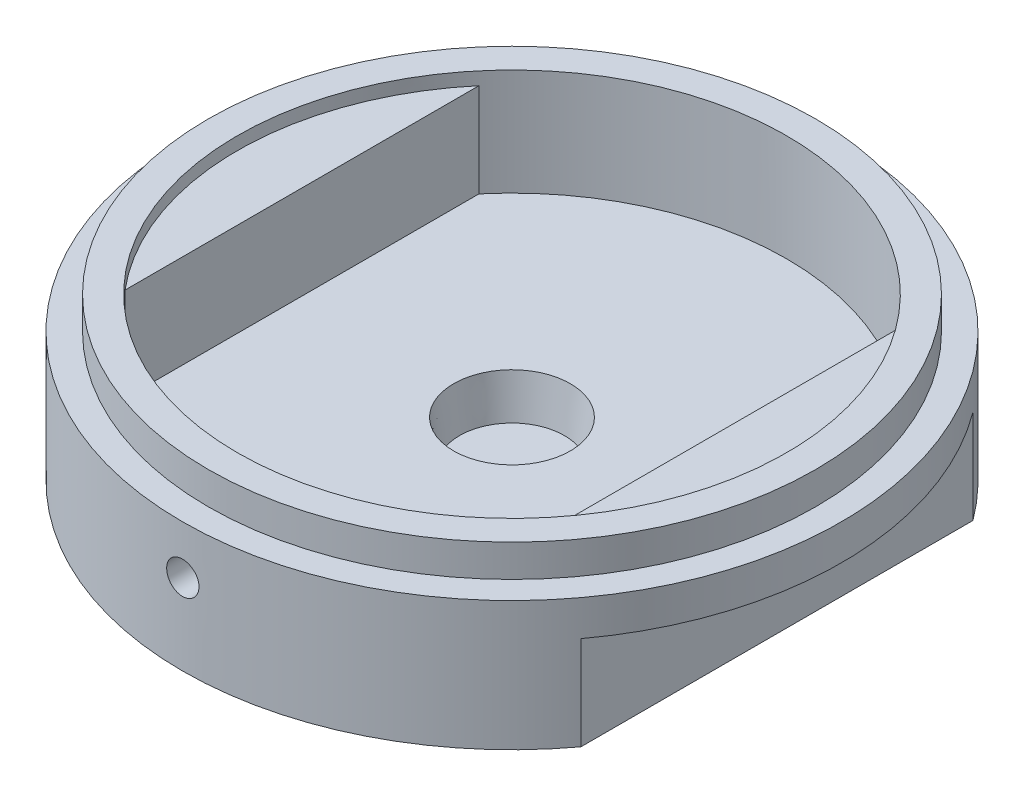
ISO-10303-21;
HEADER;
FILE_DESCRIPTION(('STEP AP214'),'2;1');
FILE_NAME('part.step','',(''),(''),'','','');
FILE_SCHEMA(('AUTOMOTIVE_DESIGN { 1 0 10303 214 1 1 1 1 }'));
ENDSEC;
DATA;
#1=APPLICATION_CONTEXT('core data for automotive mechanical design processes');
#2=APPLICATION_PROTOCOL_DEFINITION('international standard','automotive_design',2000,#1);
#3=PRODUCT_CONTEXT('',#1,'mechanical');
#4=PRODUCT('Part','Part','',(#3));
#5=PRODUCT_RELATED_PRODUCT_CATEGORY('part','',(#4));
#6=PRODUCT_DEFINITION_FORMATION('','',#4);
#7=PRODUCT_DEFINITION_CONTEXT('part definition',#1,'design');
#8=PRODUCT_DEFINITION('design','',#6,#7);
#9=PRODUCT_DEFINITION_SHAPE('','',#8);
#10=(LENGTH_UNIT() NAMED_UNIT(*) SI_UNIT(.MILLI.,.METRE.));
#11=(NAMED_UNIT(*) PLANE_ANGLE_UNIT() SI_UNIT($,.RADIAN.));
#12=(NAMED_UNIT(*) SI_UNIT($,.STERADIAN.) SOLID_ANGLE_UNIT());
#13=UNCERTAINTY_MEASURE_WITH_UNIT(LENGTH_MEASURE(1.E-05),#10,'distance_accuracy_value','');
#14=(GEOMETRIC_REPRESENTATION_CONTEXT(3) GLOBAL_UNCERTAINTY_ASSIGNED_CONTEXT((#13)) GLOBAL_UNIT_ASSIGNED_CONTEXT((#10,
#11,#12)) REPRESENTATION_CONTEXT('',''));
#15=CARTESIAN_POINT('',(0.,0.,0.));
#16=DIRECTION('',(0.,0.,1.));
#17=DIRECTION('',(1.,0.,0.));
#18=AXIS2_PLACEMENT_3D('',#15,#16,#17);
#19=CARTESIAN_POINT('',(0.,11.811,0.));
#20=DIRECTION('',(0.,-1.,0.));
#21=DIRECTION('',(0.,0.,-1.));
#22=AXIS2_PLACEMENT_3D('',#19,#20,#21);
#23=CYLINDRICAL_SURFACE('',#22,12.954);
#24=CARTESIAN_POINT('',(0.,9.144,0.));
#25=DIRECTION('',(0.,1.,0.));
#26=DIRECTION('',(0.,0.,1.));
#27=AXIS2_PLACEMENT_3D('',#24,#25,#26);
#28=CIRCLE('',#27,12.954);
#29=CARTESIAN_POINT('',(10.414,9.144,7.70420145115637));
#30=VERTEX_POINT('',#29);
#31=CARTESIAN_POINT('',(10.414,9.144,-7.70420145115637));
#32=VERTEX_POINT('',#31);
#33=EDGE_CURVE('E181',#30,#32,#28,.T.);
#34=ORIENTED_EDGE('',*,*,#33,.T.);
#35=DIRECTION('',(0.,-1.,0.));
#36=VECTOR('',#35,1.);
#37=CARTESIAN_POINT('',(10.414,11.811,-7.70420145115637));
#38=LINE('',#37,#36);
#39=CARTESIAN_POINT('',(10.414,5.461,-7.70420145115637));
#40=VERTEX_POINT('',#39);
#41=EDGE_CURVE('E11',#32,#40,#38,.T.);
#42=ORIENTED_EDGE('',*,*,#41,.T.);
#43=CARTESIAN_POINT('',(0.,5.461,0.));
#44=DIRECTION('',(0.,1.,0.));
#45=DIRECTION('',(0.,0.,1.));
#46=AXIS2_PLACEMENT_3D('',#43,#44,#45);
#47=CIRCLE('',#46,12.954);
#48=CARTESIAN_POINT('',(-10.414,5.461,-7.70420145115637));
#49=VERTEX_POINT('',#48);
#50=EDGE_CURVE('E156',#40,#49,#47,.T.);
#51=ORIENTED_EDGE('',*,*,#50,.T.);
#52=DIRECTION('',(0.,-1.,0.));
#53=VECTOR('',#52,1.);
#54=CARTESIAN_POINT('',(-10.414,11.811,-7.70420145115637));
#55=LINE('',#54,#53);
#56=CARTESIAN_POINT('',(-10.414,9.144,-7.70420145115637));
#57=VERTEX_POINT('',#56);
#58=EDGE_CURVE('E173',#49,#57,#55,.F.);
#59=ORIENTED_EDGE('',*,*,#58,.T.);
#60=CARTESIAN_POINT('',(0.,9.144,0.));
#61=DIRECTION('',(0.,1.,0.));
#62=DIRECTION('',(0.,0.,1.));
#63=AXIS2_PLACEMENT_3D('',#60,#61,#62);
#64=CIRCLE('',#63,12.954);
#65=CARTESIAN_POINT('',(-10.414,9.144,7.70420145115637));
#66=VERTEX_POINT('',#65);
#67=EDGE_CURVE('E176',#57,#66,#64,.T.);
#68=ORIENTED_EDGE('',*,*,#67,.T.);
#69=DIRECTION('',(0.,-1.,0.));
#70=VECTOR('',#69,1.);
#71=CARTESIAN_POINT('',(-10.414,11.811,7.70420145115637));
#72=LINE('',#71,#70);
#73=CARTESIAN_POINT('',(-10.414,5.461,7.70420145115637));
#74=VERTEX_POINT('',#73);
#75=EDGE_CURVE('E178',#66,#74,#72,.T.);
#76=ORIENTED_EDGE('',*,*,#75,.T.);
#77=CARTESIAN_POINT('',(10.414,5.461,7.70420145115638));
#78=VERTEX_POINT('',#77);
#79=EDGE_CURVE('E158',#74,#78,#47,.T.);
#80=ORIENTED_EDGE('',*,*,#79,.T.);
#81=DIRECTION('',(0.,-1.,0.));
#82=VECTOR('',#81,1.);
#83=CARTESIAN_POINT('',(10.414,11.811,7.70420145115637));
#84=LINE('',#83,#82);
#85=EDGE_CURVE('E39',#78,#30,#84,.F.);
#86=ORIENTED_EDGE('',*,*,#85,.T.);
#87=EDGE_LOOP('',(#34,#42,#51,#59,#68,#76,#80,#86));
#88=FACE_BOUND('',#87,.T.);
#89=CARTESIAN_POINT('',(0.,10.541,0.));
#90=DIRECTION('',(0.,1.,0.));
#91=DIRECTION('',(0.,0.,1.));
#92=AXIS2_PLACEMENT_3D('',#89,#90,#91);
#93=CIRCLE('',#92,12.954);
#94=CARTESIAN_POINT('',(0.,10.541,12.954));
#95=VERTEX_POINT('',#94);
#96=EDGE_CURVE('E145',#95,#95,#93,.T.);
#97=ORIENTED_EDGE('',*,*,#96,.F.);
#98=EDGE_LOOP('',(#97));
#99=FACE_BOUND('',#98,.T.);
#100=CARTESIAN_POINT('',(0.,8.001,12.954));
#101=CARTESIAN_POINT('',(0.0356452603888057,8.00100157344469,12.9539997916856));
#102=CARTESIAN_POINT('',(0.0713158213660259,8.0040114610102,12.9538512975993));
#103=CARTESIAN_POINT('',(0.141672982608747,8.01597584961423,12.9532732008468));
#104=CARTESIAN_POINT('',(0.176358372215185,8.02493736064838,12.9528432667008));
#105=CARTESIAN_POINT('',(0.243715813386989,8.04854785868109,12.9517509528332));
#106=CARTESIAN_POINT('',(0.276388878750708,8.06319395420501,12.9510886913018));
#107=CARTESIAN_POINT('',(0.338803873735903,8.09775344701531,12.9496063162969));
#108=CARTESIAN_POINT('',(0.368546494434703,8.11766559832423,12.9487862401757));
#109=CARTESIAN_POINT('',(0.424294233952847,8.16221365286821,12.9470795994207));
#110=CARTESIAN_POINT('',(0.450296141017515,8.18685357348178,12.9461929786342));
#111=CARTESIAN_POINT('',(0.497796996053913,8.2401497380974,12.9444536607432));
#112=CARTESIAN_POINT('',(0.519295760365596,8.26880614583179,12.9436009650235));
#113=CARTESIAN_POINT('',(0.557188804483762,8.32933854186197,12.9420252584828));
#114=CARTESIAN_POINT('',(0.573580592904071,8.36121609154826,12.9413023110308));
#115=CARTESIAN_POINT('',(0.600778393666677,8.42727489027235,12.9400683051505));
#116=CARTESIAN_POINT('',(0.611584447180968,8.46145612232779,12.9395572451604));
#117=CARTESIAN_POINT('',(0.627295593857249,8.53112261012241,12.9388051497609));
#118=CARTESIAN_POINT('',(0.632205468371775,8.56660678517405,12.9385638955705));
#119=CARTESIAN_POINT('',(0.635999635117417,8.63789643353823,12.9383779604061));
#120=CARTESIAN_POINT('',(0.63488397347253,8.67370190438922,12.9384332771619));
#121=CARTESIAN_POINT('',(0.626662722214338,8.74458526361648,12.9388340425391));
#122=CARTESIAN_POINT('',(0.619562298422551,8.77966375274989,12.9391792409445));
#123=CARTESIAN_POINT('',(0.599581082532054,8.84813031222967,12.9401204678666));
#124=CARTESIAN_POINT('',(0.586700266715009,8.8815183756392,12.9407164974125));
#125=CARTESIAN_POINT('',(0.555518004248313,8.94567296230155,12.9420924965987));
#126=CARTESIAN_POINT('',(0.537214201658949,8.97643833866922,12.9428725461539));
#127=CARTESIAN_POINT('',(0.495707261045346,9.03446168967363,12.9445285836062));
#128=CARTESIAN_POINT('',(0.472504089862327,9.0617196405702,12.9454045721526));
#129=CARTESIAN_POINT('',(0.421827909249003,9.11198445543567,12.9471548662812));
#130=CARTESIAN_POINT('',(0.394350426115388,9.13498680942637,12.9480291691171));
#131=CARTESIAN_POINT('',(0.335921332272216,9.17605272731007,12.9496766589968));
#132=CARTESIAN_POINT('',(0.304969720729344,9.19411629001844,12.9504498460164));
#133=CARTESIAN_POINT('',(0.240468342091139,9.22479143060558,12.9518079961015));
#134=CARTESIAN_POINT('',(0.206918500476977,9.23740285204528,12.9523929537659));
#135=CARTESIAN_POINT('',(0.138174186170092,9.25681277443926,12.9533086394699));
#136=CARTESIAN_POINT('',(0.102979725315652,9.26361131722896,12.953639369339));
#137=CARTESIAN_POINT('',(0.0319843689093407,9.27119694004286,12.9540090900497));
#138=CARTESIAN_POINT('',(-0.00381585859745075,9.27199025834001,12.9540483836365));
#139=CARTESIAN_POINT('',(-0.0750409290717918,9.26755919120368,12.953831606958));
#140=CARTESIAN_POINT('',(-0.110465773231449,9.26233482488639,12.9535755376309));
#141=CARTESIAN_POINT('',(-0.1799170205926,9.24602185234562,12.9527970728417));
#142=CARTESIAN_POINT('',(-0.213944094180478,9.23493609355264,12.9522748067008));
#143=CARTESIAN_POINT('',(-0.27965454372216,9.20721790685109,12.951022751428));
#144=CARTESIAN_POINT('',(-0.311337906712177,9.19058544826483,12.9502929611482));
#145=CARTESIAN_POINT('',(-0.371490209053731,9.15223001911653,12.9487072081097));
#146=CARTESIAN_POINT('',(-0.399956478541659,9.1305028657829,12.9478511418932));
#147=CARTESIAN_POINT('',(-0.452839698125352,9.08258091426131,12.9461095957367));
#148=CARTESIAN_POINT('',(-0.477256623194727,9.05638608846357,12.945224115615));
#149=CARTESIAN_POINT('',(-0.521369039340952,9.00024553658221,12.943522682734));
#150=CARTESIAN_POINT('',(-0.541060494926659,8.97029663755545,12.9427067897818));
#151=CARTESIAN_POINT('',(-0.575135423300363,8.90751411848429,12.9412374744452));
#152=CARTESIAN_POINT('',(-0.589518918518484,8.87468051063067,12.9405840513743));
#153=CARTESIAN_POINT('',(-0.612562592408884,8.80707556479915,12.9395137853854));
#154=CARTESIAN_POINT('',(-0.621225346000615,8.77230510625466,12.9390968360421));
#155=CARTESIAN_POINT('',(-0.63259005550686,8.70180115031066,12.9385462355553));
#156=CARTESIAN_POINT('',(-0.635292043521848,8.66606765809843,12.9384125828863));
#157=CARTESIAN_POINT('',(-0.634658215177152,8.59469215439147,12.9384436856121));
#158=CARTESIAN_POINT('',(-0.631328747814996,8.55905008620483,12.9386081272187));
#159=CARTESIAN_POINT('',(-0.618739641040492,8.48883158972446,12.9392162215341));
#160=CARTESIAN_POINT('',(-0.609479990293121,8.45425516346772,12.9396598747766));
#161=CARTESIAN_POINT('',(-0.585294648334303,8.38714808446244,12.9407763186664));
#162=CARTESIAN_POINT('',(-0.570368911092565,8.35461744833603,12.9414491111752));
#163=CARTESIAN_POINT('',(-0.53527620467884,8.29252346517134,12.942947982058));
#164=CARTESIAN_POINT('',(-0.515109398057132,8.2629600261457,12.9437740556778));
#165=CARTESIAN_POINT('',(-0.470084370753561,8.20760798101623,12.9454873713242));
#166=CARTESIAN_POINT('',(-0.44522174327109,8.18182296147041,12.9463746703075));
#167=CARTESIAN_POINT('',(-0.391513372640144,8.13478479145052,12.9481100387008));
#168=CARTESIAN_POINT('',(-0.362666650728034,8.11353275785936,12.9489580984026));
#169=CARTESIAN_POINT('',(-0.301786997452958,8.07615427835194,12.9505199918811));
#170=CARTESIAN_POINT('',(-0.269751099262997,8.06003266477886,12.9512336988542));
#171=CARTESIAN_POINT('',(-0.203447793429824,8.03341618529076,12.9524445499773));
#172=CARTESIAN_POINT('',(-0.169183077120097,8.02291466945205,12.9529419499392));
#173=CARTESIAN_POINT('',(-0.11225437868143,8.01059278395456,12.9535324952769));
#174=CARTESIAN_POINT('',(-0.0899591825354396,8.0070000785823,12.9537070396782));
#175=CARTESIAN_POINT('',(-0.0451127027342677,8.00220318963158,12.9539408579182));
#176=CARTESIAN_POINT('',(-0.0225614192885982,8.00099900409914,12.9540001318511));
#177=CARTESIAN_POINT('',(0.,8.001,12.954));
#178=B_SPLINE_CURVE_WITH_KNOTS('',3,(#100,#101,#102,#103,#104,#105,#106,#107,#108,#109,#110,
#111,#112,#113,#114,#115,#116,#117,#118,#119,#120,#121,#122,#123,#124,#125,#126,#127,#128,#129,
#130,#131,#132,#133,#134,#135,#136,#137,#138,#139,#140,#141,#142,#143,#144,#145,#146,#147,#148,
#149,#150,#151,#152,#153,#154,#155,#156,#157,#158,#159,#160,#161,#162,#163,#164,#165,#166,#167,
#168,#169,#170,#171,#172,#173,#174,#175,#176,#177),.UNSPECIFIED.,.T.,.F.,(4,2,2,2,2,2,2,2,2,2,2,
2,2,2,2,2,2,2,2,2,2,2,2,2,2,2,2,2,2,2,2,2,2,2,2,2,2,2,4),(0.,0.106853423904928,0.21383292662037,
0.320758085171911,0.427657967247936,0.534649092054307,0.641644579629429,0.748692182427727,
0.855738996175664,0.962698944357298,1.06965807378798,1.17652497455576,1.28339231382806,
1.39030614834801,1.49722070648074,1.60424792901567,1.71127517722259,1.81830549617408,
1.92533504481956,2.03225339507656,2.13917140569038,2.24603752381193,2.35290423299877,
2.45985898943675,2.56681440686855,2.67386084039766,2.78090682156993,2.88790458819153,
2.99490177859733,3.10178640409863,3.20867123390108,3.31555693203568,3.42243931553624,
3.52942250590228,3.63643202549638,3.74354204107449,3.85052503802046,3.91815722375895,
3.98578935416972),.UNSPECIFIED.);
#179=CARTESIAN_POINT('',(0.,8.001,12.954));
#180=VERTEX_POINT('',#179);
#181=EDGE_CURVE('E221',#180,#180,#178,.T.);
#182=ORIENTED_EDGE('',*,*,#181,.F.);
#183=EDGE_LOOP('',(#182));
#184=FACE_BOUND('',#183,.T.);
#185=ADVANCED_FACE('F26',(#88,#99,#184),#23,.T.);
#186=CARTESIAN_POINT('',(0.,11.811,0.));
#187=DIRECTION('',(0.,-1.,0.));
#188=DIRECTION('',(0.,0.,-1.));
#189=AXIS2_PLACEMENT_3D('',#186,#187,#188);
#190=CYLINDRICAL_SURFACE('',#189,10.795);
#191=CARTESIAN_POINT('',(0.,11.303,0.));
#192=DIRECTION('',(0.,1.,0.));
#193=DIRECTION('',(0.,0.,1.));
#194=AXIS2_PLACEMENT_3D('',#191,#192,#193);
#195=CIRCLE('',#194,10.795);
#196=CARTESIAN_POINT('',(8.255,11.303,6.95607648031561));
#197=VERTEX_POINT('',#196);
#198=CARTESIAN_POINT('',(8.255,11.303,-6.95607648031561));
#199=VERTEX_POINT('',#198);
#200=EDGE_CURVE('E133',#197,#199,#195,.T.);
#201=ORIENTED_EDGE('',*,*,#200,.F.);
#202=DIRECTION('',(0.,-1.,0.));
#203=VECTOR('',#202,1.);
#204=CARTESIAN_POINT('',(8.255,7.62,6.95607648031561));
#205=LINE('',#204,#203);
#206=CARTESIAN_POINT('',(8.255,7.62,6.95607648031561));
#207=VERTEX_POINT('',#206);
#208=EDGE_CURVE('E136',#207,#197,#205,.F.);
#209=ORIENTED_EDGE('',*,*,#208,.F.);
#210=CARTESIAN_POINT('',(0.,7.62,0.));
#211=DIRECTION('',(0.,1.,0.));
#212=DIRECTION('',(0.,0.,1.));
#213=AXIS2_PLACEMENT_3D('',#210,#211,#212);
#214=CIRCLE('',#213,10.795);
#215=CARTESIAN_POINT('',(-8.255,7.62,6.95607648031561));
#216=VERTEX_POINT('',#215);
#217=EDGE_CURVE('E110',#216,#207,#214,.T.);
#218=ORIENTED_EDGE('',*,*,#217,.F.);
#219=DIRECTION('',(0.,-1.,0.));
#220=VECTOR('',#219,1.);
#221=CARTESIAN_POINT('',(-8.255,11.303,6.95607648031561));
#222=LINE('',#221,#220);
#223=CARTESIAN_POINT('',(-8.255,11.303,6.95607648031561));
#224=VERTEX_POINT('',#223);
#225=EDGE_CURVE('E125',#224,#216,#222,.T.);
#226=ORIENTED_EDGE('',*,*,#225,.F.);
#227=CARTESIAN_POINT('',(0.,11.303,0.));
#228=DIRECTION('',(0.,1.,0.));
#229=DIRECTION('',(0.,0.,1.));
#230=AXIS2_PLACEMENT_3D('',#227,#228,#229);
#231=CIRCLE('',#230,10.795);
#232=CARTESIAN_POINT('',(-8.255,11.303,-6.95607648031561));
#233=VERTEX_POINT('',#232);
#234=EDGE_CURVE('E119',#233,#224,#231,.T.);
#235=ORIENTED_EDGE('',*,*,#234,.F.);
#236=DIRECTION('',(0.,-1.,0.));
#237=VECTOR('',#236,1.);
#238=CARTESIAN_POINT('',(-8.255,7.62,-6.95607648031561));
#239=LINE('',#238,#237);
#240=CARTESIAN_POINT('',(-8.255,7.62,-6.95607648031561));
#241=VERTEX_POINT('',#240);
#242=EDGE_CURVE('E115',#241,#233,#239,.F.);
#243=ORIENTED_EDGE('',*,*,#242,.F.);
#244=CARTESIAN_POINT('',(0.,7.62,0.));
#245=DIRECTION('',(0.,1.,0.));
#246=DIRECTION('',(0.,0.,1.));
#247=AXIS2_PLACEMENT_3D('',#244,#245,#246);
#248=CIRCLE('',#247,10.795);
#249=CARTESIAN_POINT('',(8.255,7.62,-6.95607648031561));
#250=VERTEX_POINT('',#249);
#251=EDGE_CURVE('E97',#250,#241,#248,.T.);
#252=ORIENTED_EDGE('',*,*,#251,.F.);
#253=DIRECTION('',(0.,-1.,0.));
#254=VECTOR('',#253,1.);
#255=CARTESIAN_POINT('',(8.255,11.303,-6.95607648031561));
#256=LINE('',#255,#254);
#257=EDGE_CURVE('E137',#199,#250,#256,.T.);
#258=ORIENTED_EDGE('',*,*,#257,.F.);
#259=EDGE_LOOP('',(#201,#209,#218,#226,#235,#243,#252,#258));
#260=FACE_BOUND('',#259,.T.);
#261=CARTESIAN_POINT('',(0.,11.811,0.));
#262=DIRECTION('',(0.,1.,0.));
#263=DIRECTION('',(0.,0.,1.));
#264=AXIS2_PLACEMENT_3D('',#261,#262,#263);
#265=CIRCLE('',#264,10.795);
#266=CARTESIAN_POINT('',(0.,11.811,10.795));
#267=VERTEX_POINT('',#266);
#268=EDGE_CURVE('E146',#267,#267,#265,.T.);
#269=ORIENTED_EDGE('',*,*,#268,.T.);
#270=EDGE_LOOP('',(#269));
#271=FACE_BOUND('',#270,.T.);
#272=CARTESIAN_POINT('',(-0.635,8.636,10.776307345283));
#273=CARTESIAN_POINT('',(-0.634998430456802,8.60036489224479,10.776307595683));
#274=CARTESIAN_POINT('',(-0.631990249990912,8.56470473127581,10.7764860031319));
#275=CARTESIAN_POINT('',(-0.620033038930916,8.49436878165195,10.7771804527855));
#276=CARTESIAN_POINT('',(-0.6110770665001,8.45969419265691,10.7776968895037));
#277=CARTESIAN_POINT('',(-0.58748214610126,8.39235841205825,10.7790086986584));
#278=CARTESIAN_POINT('',(-0.572846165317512,8.35969617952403,10.7798039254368));
#279=CARTESIAN_POINT('',(-0.538311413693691,8.29730070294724,10.7815835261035));
#280=CARTESIAN_POINT('',(-0.518413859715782,8.26756678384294,10.782567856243));
#281=CARTESIAN_POINT('',(-0.473891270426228,8.21182326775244,10.7846162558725));
#282=CARTESIAN_POINT('',(-0.449260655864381,8.18581812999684,10.7856804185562));
#283=CARTESIAN_POINT('',(-0.395982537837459,8.13830849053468,10.7877677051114));
#284=CARTESIAN_POINT('',(-0.367334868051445,8.11680417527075,10.7887908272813));
#285=CARTESIAN_POINT('',(-0.306811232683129,8.07889334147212,10.790681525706));
#286=CARTESIAN_POINT('',(-0.274932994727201,8.06249044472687,10.7915489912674));
#287=CARTESIAN_POINT('',(-0.208869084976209,8.03527127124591,10.7930296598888));
#288=CARTESIAN_POINT('',(-0.174683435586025,8.02445494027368,10.7936428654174));
#289=CARTESIAN_POINT('',(-0.105017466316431,8.00872812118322,10.7945452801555));
#290=CARTESIAN_POINT('',(-0.0695387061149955,8.00381074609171,10.7948348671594));
#291=CARTESIAN_POINT('',(0.00174176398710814,8.00000016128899,10.7950586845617));
#292=CARTESIAN_POINT('',(0.0375434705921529,8.00110689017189,10.7949929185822));
#293=CARTESIAN_POINT('',(0.108406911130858,8.0093074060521,10.794513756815));
#294=CARTESIAN_POINT('',(0.143469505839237,8.01639378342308,10.7941007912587));
#295=CARTESIAN_POINT('',(0.211906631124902,8.03634094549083,10.7929742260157));
#296=CARTESIAN_POINT('',(0.245281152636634,8.04920176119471,10.7922606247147));
#297=CARTESIAN_POINT('',(0.309418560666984,8.08034113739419,10.7906124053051));
#298=CARTESIAN_POINT('',(0.340179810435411,8.09862306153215,10.7896776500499));
#299=CARTESIAN_POINT('',(0.398199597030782,8.14008324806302,10.7876923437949));
#300=CARTESIAN_POINT('',(0.425458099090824,8.1632615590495,10.7866417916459));
#301=CARTESIAN_POINT('',(0.475741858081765,8.21389843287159,10.7845412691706));
#302=CARTESIAN_POINT('',(0.498760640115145,8.24136342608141,10.7834913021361));
#303=CARTESIAN_POINT('',(0.539861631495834,8.29977148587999,10.7815119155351));
#304=CARTESIAN_POINT('',(0.557943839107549,8.33071455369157,10.7805824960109));
#305=CARTESIAN_POINT('',(0.588657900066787,8.39520445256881,10.7789491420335));
#306=CARTESIAN_POINT('',(0.601289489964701,8.42875140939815,10.7782452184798));
#307=CARTESIAN_POINT('',(0.620739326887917,8.49749496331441,10.7771426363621));
#308=CARTESIAN_POINT('',(0.627557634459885,8.53269154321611,10.7767439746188));
#309=CARTESIAN_POINT('',(0.635179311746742,8.60367878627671,10.7762974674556));
#310=CARTESIAN_POINT('',(0.635991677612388,8.63946848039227,10.7762490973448));
#311=CARTESIAN_POINT('',(0.631601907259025,8.71067564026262,10.7765072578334));
#312=CARTESIAN_POINT('',(0.626399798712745,8.74609310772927,10.7768137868));
#313=CARTESIAN_POINT('',(0.610136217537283,8.81552505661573,10.7777467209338));
#314=CARTESIAN_POINT('',(0.599078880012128,8.84954050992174,10.778372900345));
#315=CARTESIAN_POINT('',(0.571422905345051,8.91523283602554,10.7798743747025));
#316=CARTESIAN_POINT('',(0.554824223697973,8.94690969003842,10.7807496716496));
#317=CARTESIAN_POINT('',(0.516533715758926,9.00706697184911,10.7826520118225));
#318=CARTESIAN_POINT('',(0.494835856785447,9.03554355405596,10.7836792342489));
#319=CARTESIAN_POINT('',(0.446971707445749,9.08845322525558,10.785769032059));
#320=CARTESIAN_POINT('',(0.420805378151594,9.11288627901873,10.7868316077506));
#321=CARTESIAN_POINT('',(0.364708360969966,9.15704566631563,10.7888739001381));
#322=CARTESIAN_POINT('',(0.334773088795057,9.17676618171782,10.7898535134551));
#323=CARTESIAN_POINT('',(0.272011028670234,9.21090089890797,10.7916180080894));
#324=CARTESIAN_POINT('',(0.239184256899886,9.22531513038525,10.7924028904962));
#325=CARTESIAN_POINT('',(0.171592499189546,9.24841797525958,10.793688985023));
#326=CARTESIAN_POINT('',(0.136828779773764,9.25711028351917,10.7941903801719));
#327=CARTESIAN_POINT('',(0.0663322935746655,9.26853463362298,10.794853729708));
#328=CARTESIAN_POINT('',(0.0305995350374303,9.27126672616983,10.7950156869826));
#329=CARTESIAN_POINT('',(-0.040763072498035,9.27069260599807,10.7949819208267));
#330=CARTESIAN_POINT('',(-0.0763929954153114,9.26739550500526,10.7947867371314));
#331=CARTESIAN_POINT('',(-0.146592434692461,9.25487546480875,10.7940617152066));
#332=CARTESIAN_POINT('',(-0.181161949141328,9.24565251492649,10.7935318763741));
#333=CARTESIAN_POINT('',(-0.248260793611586,9.22154458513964,10.7921971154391));
#334=CARTESIAN_POINT('',(-0.280790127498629,9.20665961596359,10.7913921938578));
#335=CARTESIAN_POINT('',(-0.342889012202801,9.17165152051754,10.7895976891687));
#336=CARTESIAN_POINT('',(-0.372458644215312,9.15152853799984,10.7886081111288));
#337=CARTESIAN_POINT('',(-0.427844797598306,9.10658220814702,10.7865538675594));
#338=CARTESIAN_POINT('',(-0.453656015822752,9.08175233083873,10.7854890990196));
#339=CARTESIAN_POINT('',(-0.500752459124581,9.02810473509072,10.7834052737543));
#340=CARTESIAN_POINT('',(-0.522036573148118,8.99928604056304,10.7823862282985));
#341=CARTESIAN_POINT('',(-0.559488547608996,8.93844920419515,10.7805079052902));
#342=CARTESIAN_POINT('',(-0.575650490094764,8.906427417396,10.7796488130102));
#343=CARTESIAN_POINT('',(-0.602348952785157,8.84014324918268,10.7781900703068));
#344=CARTESIAN_POINT('',(-0.612892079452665,8.80588355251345,10.7775901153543));
#345=CARTESIAN_POINT('',(-0.62530535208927,8.74884434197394,10.7768752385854));
#346=CARTESIAN_POINT('',(-0.628936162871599,8.72643377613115,10.7766632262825));
#347=CARTESIAN_POINT('',(-0.633783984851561,8.68135218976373,10.7763792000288));
#348=CARTESIAN_POINT('',(-0.635000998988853,8.65868116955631,10.7763071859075));
#349=CARTESIAN_POINT('',(-0.635,8.636,10.776307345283));
#350=B_SPLINE_CURVE_WITH_KNOTS('',3,(#272,#273,#274,#275,#276,#277,#278,#279,#280,#281,#282,
#283,#284,#285,#286,#287,#288,#289,#290,#291,#292,#293,#294,#295,#296,#297,#298,#299,#300,#301,
#302,#303,#304,#305,#306,#307,#308,#309,#310,#311,#312,#313,#314,#315,#316,#317,#318,#319,#320,
#321,#322,#323,#324,#325,#326,#327,#328,#329,#330,#331,#332,#333,#334,#335,#336,#337,#338,#339,
#340,#341,#342,#343,#344,#345,#346,#347,#348,#349),.UNSPECIFIED.,.T.,.F.,(4,2,2,2,2,2,2,2,2,2,2,
2,2,2,2,2,2,2,2,2,2,2,2,2,2,2,2,2,2,2,2,2,2,2,2,2,2,2,4),(0.,0.106822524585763,
0.213769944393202,0.320661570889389,0.4275284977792,0.534522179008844,0.641520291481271,
0.748594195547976,0.855667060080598,0.96261479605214,1.06956144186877,1.17637576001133,
1.2831906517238,1.39007195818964,1.49695432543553,1.60399859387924,1.71104289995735,
1.8180923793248,1.92514074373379,2.03202873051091,2.13891622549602,2.24572833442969,
2.35254130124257,2.45948127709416,2.56642218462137,2.67349444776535,2.78056611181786,
2.8875685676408,2.99457011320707,3.10141008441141,3.20825024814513,3.31509020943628,
3.42192723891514,3.52891358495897,3.63592615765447,3.74306192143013,3.85007143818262,
3.91806232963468,3.98605313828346),.UNSPECIFIED.);
#351=CARTESIAN_POINT('',(-0.635,8.636,10.776307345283));
#352=VERTEX_POINT('',#351);
#353=EDGE_CURVE('E30',#352,#352,#350,.T.);
#354=ORIENTED_EDGE('',*,*,#353,.T.);
#355=EDGE_LOOP('',(#354));
#356=FACE_BOUND('',#355,.T.);
#357=ADVANCED_FACE('F116',(#260,#271,#356),#190,.F.);
#358=CARTESIAN_POINT('',(0.,3.81,0.));
#359=DIRECTION('',(0.,-1.,0.));
#360=DIRECTION('',(0.,0.,-1.));
#361=AXIS2_PLACEMENT_3D('',#358,#359,#360);
#362=CYLINDRICAL_SURFACE('',#361,1.905);
#363=CARTESIAN_POINT('',(0.,3.81,0.));
#364=DIRECTION('',(0.,1.,0.));
#365=DIRECTION('',(0.,0.,1.));
#366=AXIS2_PLACEMENT_3D('',#363,#364,#365);
#367=CIRCLE('',#366,1.905);
#368=CARTESIAN_POINT('',(0.,3.81,-1.905));
#369=VERTEX_POINT('',#368);
#370=EDGE_CURVE('E170',#369,#369,#367,.T.);
#371=CARTESIAN_POINT('',(0.,0.,0.));
#372=DIRECTION('',(0.,1.,0.));
#373=DIRECTION('',(0.,0.,1.));
#374=AXIS2_PLACEMENT_3D('',#371,#372,#373);
#375=CIRCLE('',#374,1.905);
#376=CARTESIAN_POINT('',(0.,0.,-1.905));
#377=VERTEX_POINT('',#376);
#378=EDGE_CURVE('E167',#377,#377,#375,.T.);
#379=CARTESIAN_POINT('',(0.,3.81,-1.905));
#380=CARTESIAN_POINT('',(0.,3.7703125,-1.905));
#381=CARTESIAN_POINT('',(0.,3.730625,-1.905));
#382=CARTESIAN_POINT('',(0.,3.65125,-1.905));
#383=CARTESIAN_POINT('',(0.,3.6115625,-1.905));
#384=CARTESIAN_POINT('',(0.,3.5321875,-1.905));
#385=CARTESIAN_POINT('',(0.,3.4925,-1.905));
#386=CARTESIAN_POINT('',(0.,3.413125,-1.905));
#387=CARTESIAN_POINT('',(0.,3.3734375,-1.905));
#388=CARTESIAN_POINT('',(0.,3.2940625,-1.905));
#389=CARTESIAN_POINT('',(0.,3.254375,-1.905));
#390=CARTESIAN_POINT('',(0.,3.175,-1.905));
#391=CARTESIAN_POINT('',(0.,3.1353125,-1.905));
#392=CARTESIAN_POINT('',(0.,3.0559375,-1.905));
#393=CARTESIAN_POINT('',(0.,3.01625,-1.905));
#394=CARTESIAN_POINT('',(0.,2.936875,-1.905));
#395=CARTESIAN_POINT('',(0.,2.8971875,-1.905));
#396=CARTESIAN_POINT('',(0.,2.8178125,-1.905));
#397=CARTESIAN_POINT('',(0.,2.778125,-1.905));
#398=CARTESIAN_POINT('',(0.,2.69875,-1.905));
#399=CARTESIAN_POINT('',(0.,2.6590625,-1.905));
#400=CARTESIAN_POINT('',(0.,2.5796875,-1.905));
#401=CARTESIAN_POINT('',(0.,2.54,-1.905));
#402=CARTESIAN_POINT('',(0.,2.460625,-1.905));
#403=CARTESIAN_POINT('',(0.,2.4209375,-1.905));
#404=CARTESIAN_POINT('',(0.,2.3415625,-1.905));
#405=CARTESIAN_POINT('',(0.,2.301875,-1.905));
#406=CARTESIAN_POINT('',(0.,2.2225,-1.905));
#407=CARTESIAN_POINT('',(0.,2.1828125,-1.905));
#408=CARTESIAN_POINT('',(0.,2.1034375,-1.905));
#409=CARTESIAN_POINT('',(0.,2.06375,-1.905));
#410=CARTESIAN_POINT('',(0.,1.984375,-1.905));
#411=CARTESIAN_POINT('',(0.,1.9446875,-1.905));
#412=CARTESIAN_POINT('',(0.,1.8653125,-1.905));
#413=CARTESIAN_POINT('',(0.,1.825625,-1.905));
#414=CARTESIAN_POINT('',(0.,1.74625,-1.905));
#415=CARTESIAN_POINT('',(0.,1.7065625,-1.905));
#416=CARTESIAN_POINT('',(0.,1.6271875,-1.905));
#417=CARTESIAN_POINT('',(0.,1.5875,-1.905));
#418=CARTESIAN_POINT('',(0.,1.508125,-1.905));
#419=CARTESIAN_POINT('',(0.,1.4684375,-1.905));
#420=CARTESIAN_POINT('',(0.,1.3890625,-1.905));
#421=CARTESIAN_POINT('',(0.,1.349375,-1.905));
#422=CARTESIAN_POINT('',(0.,1.27,-1.905));
#423=CARTESIAN_POINT('',(0.,1.2303125,-1.905));
#424=CARTESIAN_POINT('',(0.,1.1509375,-1.905));
#425=CARTESIAN_POINT('',(0.,1.11125,-1.905));
#426=CARTESIAN_POINT('',(0.,1.031875,-1.905));
#427=CARTESIAN_POINT('',(0.,0.9921875,-1.905));
#428=CARTESIAN_POINT('',(0.,0.9128125,-1.905));
#429=CARTESIAN_POINT('',(0.,0.873125,-1.905));
#430=CARTESIAN_POINT('',(0.,0.79375,-1.905));
#431=CARTESIAN_POINT('',(0.,0.7540625,-1.905));
#432=CARTESIAN_POINT('',(0.,0.6746875,-1.905));
#433=CARTESIAN_POINT('',(0.,0.635,-1.905));
#434=CARTESIAN_POINT('',(0.,0.555625,-1.905));
#435=CARTESIAN_POINT('',(0.,0.5159375,-1.905));
#436=CARTESIAN_POINT('',(0.,0.4365625,-1.905));
#437=CARTESIAN_POINT('',(0.,0.396875,-1.905));
#438=CARTESIAN_POINT('',(0.,0.3175,-1.905));
#439=CARTESIAN_POINT('',(0.,0.2778125,-1.905));
#440=CARTESIAN_POINT('',(0.,0.1984375,-1.905));
#441=CARTESIAN_POINT('',(0.,0.15875,-1.905));
#442=CARTESIAN_POINT('',(0.,0.0793749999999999,-1.905));
#443=CARTESIAN_POINT('',(0.,0.0396874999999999,-1.905));
#444=CARTESIAN_POINT('',(0.,0.,-1.905));
#445=B_SPLINE_CURVE_WITH_KNOTS('',3,(#379,#380,#381,#382,#383,#384,#385,#386,#387,#388,#389,
#390,#391,#392,#393,#394,#395,#396,#397,#398,#399,#400,#401,#402,#403,#404,#405,#406,#407,#408,
#409,#410,#411,#412,#413,#414,#415,#416,#417,#418,#419,#420,#421,#422,#423,#424,#425,#426,#427,
#428,#429,#430,#431,#432,#433,#434,#435,#436,#437,#438,#439,#440,#441,#442,#443,#444),
.UNSPECIFIED.,.F.,.F.,(4,2,2,2,2,2,2,2,2,2,2,2,2,2,2,2,2,2,2,2,2,2,2,2,2,2,2,2,2,2,2,2,4),(0.,
0.1190625,0.238125,0.3571875,0.47625,0.5953125,0.714375,0.8334375,0.9525,1.0715625,1.190625,
1.3096875,1.42875,1.5478125,1.666875,1.7859375,1.905,2.0240625,2.143125,2.2621875,2.38125,
2.5003125,2.619375,2.7384375,2.8575,2.9765625,3.095625,3.2146875,3.33375,3.4528125,3.571875,
3.6909375,3.81),.UNSPECIFIED.);
#446=EDGE_CURVE('BSEAM28',#369,#377,#445,.T.);
#447=ORIENTED_EDGE('',*,*,#370,.F.);
#448=ORIENTED_EDGE('',*,*,#378,.T.);
#449=ORIENTED_EDGE('',*,*,#446,.T.);
#450=ORIENTED_EDGE('',*,*,#446,.F.);
#451=EDGE_LOOP('',(#447,#449,#448,#450));
#452=FACE_BOUND('',#451,.T.);
#453=ADVANCED_FACE('F28',(#452),#362,.T.);
#454=CARTESIAN_POINT('',(0.,0.,0.));
#455=DIRECTION('',(0.,1.,0.));
#456=DIRECTION('',(0.,0.,1.));
#457=AXIS2_PLACEMENT_3D('',#454,#455,#456);
#458=PLANE('',#457);
#459=ORIENTED_EDGE('',*,*,#378,.F.);
#460=EDGE_LOOP('',(#459));
#461=FACE_BOUND('',#460,.T.);
#462=ADVANCED_FACE('F375',(#461),#458,.F.);
#463=CARTESIAN_POINT('',(0.,3.81,0.));
#464=DIRECTION('',(0.,1.,0.));
#465=DIRECTION('',(0.,0.,1.));
#466=AXIS2_PLACEMENT_3D('',#463,#464,#465);
#467=PLANE('',#466);
#468=CARTESIAN_POINT('',(0.,3.81,0.));
#469=DIRECTION('',(0.,1.,0.));
#470=DIRECTION('',(0.,0.,1.));
#471=AXIS2_PLACEMENT_3D('',#468,#469,#470);
#472=CIRCLE('',#471,3.937);
#473=CARTESIAN_POINT('',(0.,3.81,3.937));
#474=VERTEX_POINT('',#473);
#475=EDGE_CURVE('E161',#474,#474,#472,.T.);
#476=ORIENTED_EDGE('',*,*,#475,.F.);
#477=EDGE_LOOP('',(#476));
#478=FACE_BOUND('',#477,.T.);
#479=ORIENTED_EDGE('',*,*,#370,.T.);
#480=EDGE_LOOP('',(#479));
#481=FACE_BOUND('',#480,.T.);
#482=ADVANCED_FACE('F218',(#478,#481),#467,.F.);
#483=CARTESIAN_POINT('',(0.,3.81,0.));
#484=DIRECTION('',(0.,1.,0.));
#485=DIRECTION('',(0.,0.,1.));
#486=AXIS2_PLACEMENT_3D('',#483,#484,#485);
#487=CONICAL_SURFACE('',#486,3.937,0.139626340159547);
#488=CARTESIAN_POINT('',(0.,5.461,0.));
#489=DIRECTION('',(0.,1.,0.));
#490=DIRECTION('',(0.,0.,1.));
#491=AXIS2_PLACEMENT_3D('',#488,#489,#490);
#492=CIRCLE('',#491,4.16903291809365);
#493=CARTESIAN_POINT('',(0.,5.461,4.16903291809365));
#494=VERTEX_POINT('',#493);
#495=EDGE_CURVE('E164',#494,#494,#492,.T.);
#496=ORIENTED_EDGE('',*,*,#495,.F.);
#497=EDGE_LOOP('',(#496));
#498=FACE_BOUND('',#497,.T.);
#499=ORIENTED_EDGE('',*,*,#475,.T.);
#500=EDGE_LOOP('',(#499));
#501=FACE_BOUND('',#500,.T.);
#502=ADVANCED_FACE('F205',(#498,#501),#487,.T.);
#503=CARTESIAN_POINT('',(0.,5.461,0.));
#504=DIRECTION('',(0.,1.,0.));
#505=DIRECTION('',(0.,0.,1.));
#506=AXIS2_PLACEMENT_3D('',#503,#504,#505);
#507=PLANE('',#506);
#508=ORIENTED_EDGE('',*,*,#50,.F.);
#509=DIRECTION('',(0.,0.,1.));
#510=VECTOR('',#509,1.);
#511=CARTESIAN_POINT('',(10.414,5.461,-12.954));
#512=LINE('',#511,#510);
#513=EDGE_CURVE('E150',#40,#78,#512,.T.);
#514=ORIENTED_EDGE('',*,*,#513,.T.);
#515=ORIENTED_EDGE('',*,*,#79,.F.);
#516=DIRECTION('',(0.,0.,1.));
#517=VECTOR('',#516,1.);
#518=CARTESIAN_POINT('',(-10.414,5.461,-12.954));
#519=LINE('',#518,#517);
#520=EDGE_CURVE('E153',#49,#74,#519,.T.);
#521=ORIENTED_EDGE('',*,*,#520,.F.);
#522=EDGE_LOOP('',(#508,#514,#515,#521));
#523=FACE_BOUND('',#522,.T.);
#524=ORIENTED_EDGE('',*,*,#495,.T.);
#525=EDGE_LOOP('',(#524));
#526=FACE_BOUND('',#525,.T.);
#527=ADVANCED_FACE('F192',(#523,#526),#507,.F.);
#528=CARTESIAN_POINT('',(-12.954,9.144,-12.954));
#529=DIRECTION('',(0.,1.,0.));
#530=DIRECTION('',(0.,0.,1.));
#531=AXIS2_PLACEMENT_3D('',#528,#529,#530);
#532=PLANE('',#531);
#533=DIRECTION('',(0.,0.,1.));
#534=VECTOR('',#533,1.);
#535=CARTESIAN_POINT('',(-10.414,9.144,-12.954));
#536=LINE('',#535,#534);
#537=EDGE_CURVE('E53',#57,#66,#536,.T.);
#538=ORIENTED_EDGE('',*,*,#537,.T.);
#539=ORIENTED_EDGE('',*,*,#67,.F.);
#540=EDGE_LOOP('',(#538,#539));
#541=FACE_BOUND('',#540,.T.);
#542=ADVANCED_FACE('F197',(#541),#532,.F.);
#543=CARTESIAN_POINT('',(-10.414,9.144,-12.954));
#544=DIRECTION('',(1.,0.,0.));
#545=DIRECTION('',(0.,1.,0.));
#546=AXIS2_PLACEMENT_3D('',#543,#544,#545);
#547=PLANE('',#546);
#548=ORIENTED_EDGE('',*,*,#537,.F.);
#549=ORIENTED_EDGE('',*,*,#58,.F.);
#550=ORIENTED_EDGE('',*,*,#520,.T.);
#551=ORIENTED_EDGE('',*,*,#75,.F.);
#552=EDGE_LOOP('',(#548,#549,#550,#551));
#553=FACE_BOUND('',#552,.T.);
#554=ADVANCED_FACE('F195',(#553),#547,.F.);
#555=CARTESIAN_POINT('',(10.414,5.461,-12.954));
#556=DIRECTION('',(-1.,0.,0.));
#557=DIRECTION('',(0.,0.,1.));
#558=AXIS2_PLACEMENT_3D('',#555,#556,#557);
#559=PLANE('',#558);
#560=DIRECTION('',(0.,0.,1.));
#561=VECTOR('',#560,1.);
#562=CARTESIAN_POINT('',(10.414,9.144,-12.954));
#563=LINE('',#562,#561);
#564=EDGE_CURVE('E45',#32,#30,#563,.T.);
#565=ORIENTED_EDGE('',*,*,#564,.T.);
#566=ORIENTED_EDGE('',*,*,#85,.F.);
#567=ORIENTED_EDGE('',*,*,#513,.F.);
#568=ORIENTED_EDGE('',*,*,#41,.F.);
#569=EDGE_LOOP('',(#565,#566,#567,#568));
#570=FACE_BOUND('',#569,.T.);
#571=ADVANCED_FACE('F189',(#570),#559,.F.);
#572=CARTESIAN_POINT('',(12.954,9.144,-12.954));
#573=DIRECTION('',(0.,1.,0.));
#574=DIRECTION('',(0.,0.,1.));
#575=AXIS2_PLACEMENT_3D('',#572,#573,#574);
#576=PLANE('',#575);
#577=ORIENTED_EDGE('',*,*,#564,.F.);
#578=ORIENTED_EDGE('',*,*,#33,.F.);
#579=EDGE_LOOP('',(#577,#578));
#580=FACE_BOUND('',#579,.T.);
#581=ADVANCED_FACE('F242',(#580),#576,.F.);
#582=CARTESIAN_POINT('',(0.,10.541,0.));
#583=DIRECTION('',(0.,1.,0.));
#584=DIRECTION('',(0.,0.,1.));
#585=AXIS2_PLACEMENT_3D('',#582,#583,#584);
#586=PLANE('',#585);
#587=CARTESIAN_POINT('',(0.,10.541,0.));
#588=DIRECTION('',(0.,1.,0.));
#589=DIRECTION('',(0.,0.,1.));
#590=AXIS2_PLACEMENT_3D('',#587,#588,#589);
#591=CIRCLE('',#590,11.938);
#592=CARTESIAN_POINT('',(0.,10.541,11.938));
#593=VERTEX_POINT('',#592);
#594=EDGE_CURVE('E323',#593,#593,#591,.T.);
#595=ORIENTED_EDGE('',*,*,#594,.F.);
#596=EDGE_LOOP('',(#595));
#597=FACE_BOUND('',#596,.T.);
#598=ORIENTED_EDGE('',*,*,#96,.T.);
#599=EDGE_LOOP('',(#598));
#600=FACE_BOUND('',#599,.T.);
#601=ADVANCED_FACE('F238',(#597,#600),#586,.T.);
#602=CARTESIAN_POINT('',(0.,10.541,0.));
#603=DIRECTION('',(0.,1.,0.));
#604=DIRECTION('',(0.,0.,1.));
#605=AXIS2_PLACEMENT_3D('',#602,#603,#604);
#606=CYLINDRICAL_SURFACE('',#605,11.938);
#607=ORIENTED_EDGE('',*,*,#594,.T.);
#608=EDGE_LOOP('',(#607));
#609=FACE_BOUND('',#608,.T.);
#610=CARTESIAN_POINT('',(0.,11.811,0.));
#611=DIRECTION('',(0.,1.,0.));
#612=DIRECTION('',(0.,0.,1.));
#613=AXIS2_PLACEMENT_3D('',#610,#611,#612);
#614=CIRCLE('',#613,11.938);
#615=CARTESIAN_POINT('',(0.,11.811,11.938));
#616=VERTEX_POINT('',#615);
#617=EDGE_CURVE('E226',#616,#616,#614,.T.);
#618=ORIENTED_EDGE('',*,*,#617,.F.);
#619=EDGE_LOOP('',(#618));
#620=FACE_BOUND('',#619,.T.);
#621=ADVANCED_FACE('F233',(#609,#620),#606,.T.);
#622=CARTESIAN_POINT('',(0.,5.969,0.));
#623=DIRECTION('',(0.,1.,0.));
#624=DIRECTION('',(0.,0.,1.));
#625=AXIS2_PLACEMENT_3D('',#622,#623,#624);
#626=PLANE('',#625);
#627=CARTESIAN_POINT('',(0.,5.969,0.));
#628=DIRECTION('',(0.,1.,0.));
#629=DIRECTION('',(0.,0.,1.));
#630=AXIS2_PLACEMENT_3D('',#627,#628,#629);
#631=CIRCLE('',#630,2.06020993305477);
#632=CARTESIAN_POINT('',(0.,5.969,2.06020993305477));
#633=VERTEX_POINT('',#632);
#634=EDGE_CURVE('E149',#633,#633,#631,.T.);
#635=ORIENTED_EDGE('',*,*,#634,.T.);
#636=EDGE_LOOP('',(#635));
#637=FACE_BOUND('',#636,.T.);
#638=ADVANCED_FACE('F237',(#637),#626,.T.);
#639=CARTESIAN_POINT('',(0.,4.11047472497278,0.));
#640=DIRECTION('',(0.,1.,0.));
#641=DIRECTION('',(0.,0.,1.));
#642=AXIS2_PLACEMENT_3D('',#639,#640,#641);
#643=CONICAL_SURFACE('',#642,1.79901123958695,0.139626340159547);
#644=CARTESIAN_POINT('',(0.,7.62,0.));
#645=DIRECTION('',(0.,1.,0.));
#646=DIRECTION('',(0.,0.,1.));
#647=AXIS2_PLACEMENT_3D('',#644,#645,#646);
#648=CIRCLE('',#647,2.29224285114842);
#649=CARTESIAN_POINT('',(0.,7.62,2.29224285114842));
#650=VERTEX_POINT('',#649);
#651=EDGE_CURVE('E122',#650,#650,#648,.T.);
#652=ORIENTED_EDGE('',*,*,#651,.T.);
#653=EDGE_LOOP('',(#652));
#654=FACE_BOUND('',#653,.T.);
#655=ORIENTED_EDGE('',*,*,#634,.F.);
#656=EDGE_LOOP('',(#655));
#657=FACE_BOUND('',#656,.T.);
#658=ADVANCED_FACE('F246',(#654,#657),#643,.F.);
#659=CARTESIAN_POINT('',(-12.954,11.303,-12.954));
#660=DIRECTION('',(0.,1.,0.));
#661=DIRECTION('',(0.,0.,1.));
#662=AXIS2_PLACEMENT_3D('',#659,#660,#661);
#663=PLANE('',#662);
#664=DIRECTION('',(0.,0.,1.));
#665=VECTOR('',#664,1.);
#666=CARTESIAN_POINT('',(-8.255,11.303,-12.954));
#667=LINE('',#666,#665);
#668=EDGE_CURVE('E111',#233,#224,#667,.T.);
#669=ORIENTED_EDGE('',*,*,#668,.F.);
#670=ORIENTED_EDGE('',*,*,#234,.T.);
#671=EDGE_LOOP('',(#669,#670));
#672=FACE_BOUND('',#671,.T.);
#673=ADVANCED_FACE('F250',(#672),#663,.T.);
#674=CARTESIAN_POINT('',(-8.255,9.144,-12.954));
#675=DIRECTION('',(1.,0.,0.));
#676=DIRECTION('',(0.,1.,0.));
#677=AXIS2_PLACEMENT_3D('',#674,#675,#676);
#678=PLANE('',#677);
#679=ORIENTED_EDGE('',*,*,#668,.T.);
#680=ORIENTED_EDGE('',*,*,#225,.T.);
#681=DIRECTION('',(0.,0.,1.));
#682=VECTOR('',#681,1.);
#683=CARTESIAN_POINT('',(-8.255,7.62,-12.954));
#684=LINE('',#683,#682);
#685=EDGE_CURVE('E103',#241,#216,#684,.T.);
#686=ORIENTED_EDGE('',*,*,#685,.F.);
#687=ORIENTED_EDGE('',*,*,#242,.T.);
#688=EDGE_LOOP('',(#679,#680,#686,#687));
#689=FACE_BOUND('',#688,.T.);
#690=ADVANCED_FACE('F124',(#689),#678,.T.);
#691=CARTESIAN_POINT('',(0.,7.62,0.));
#692=DIRECTION('',(0.,1.,0.));
#693=DIRECTION('',(0.,0.,1.));
#694=AXIS2_PLACEMENT_3D('',#691,#692,#693);
#695=PLANE('',#694);
#696=ORIENTED_EDGE('',*,*,#251,.T.);
#697=ORIENTED_EDGE('',*,*,#685,.T.);
#698=ORIENTED_EDGE('',*,*,#217,.T.);
#699=DIRECTION('',(0.,0.,1.));
#700=VECTOR('',#699,1.);
#701=CARTESIAN_POINT('',(8.255,7.62,0.));
#702=LINE('',#701,#700);
#703=EDGE_CURVE('E106',#250,#207,#702,.T.);
#704=ORIENTED_EDGE('',*,*,#703,.F.);
#705=EDGE_LOOP('',(#696,#697,#698,#704));
#706=FACE_BOUND('',#705,.T.);
#707=ORIENTED_EDGE('',*,*,#651,.F.);
#708=EDGE_LOOP('',(#707));
#709=FACE_BOUND('',#708,.T.);
#710=ADVANCED_FACE('F99',(#706,#709),#695,.T.);
#711=CARTESIAN_POINT('',(8.255,5.461,-12.954));
#712=DIRECTION('',(-1.,0.,0.));
#713=DIRECTION('',(0.,0.,1.));
#714=AXIS2_PLACEMENT_3D('',#711,#712,#713);
#715=PLANE('',#714);
#716=DIRECTION('',(0.,0.,1.));
#717=VECTOR('',#716,1.);
#718=CARTESIAN_POINT('',(8.255,11.303,-12.954));
#719=LINE('',#718,#717);
#720=EDGE_CURVE('E129',#199,#197,#719,.T.);
#721=ORIENTED_EDGE('',*,*,#720,.F.);
#722=ORIENTED_EDGE('',*,*,#257,.T.);
#723=ORIENTED_EDGE('',*,*,#703,.T.);
#724=ORIENTED_EDGE('',*,*,#208,.T.);
#725=EDGE_LOOP('',(#721,#722,#723,#724));
#726=FACE_BOUND('',#725,.T.);
#727=ADVANCED_FACE('F253',(#726),#715,.T.);
#728=CARTESIAN_POINT('',(12.954,11.303,-12.954));
#729=DIRECTION('',(0.,1.,0.));
#730=DIRECTION('',(0.,0.,1.));
#731=AXIS2_PLACEMENT_3D('',#728,#729,#730);
#732=PLANE('',#731);
#733=ORIENTED_EDGE('',*,*,#720,.T.);
#734=ORIENTED_EDGE('',*,*,#200,.T.);
#735=EDGE_LOOP('',(#733,#734));
#736=FACE_BOUND('',#735,.T.);
#737=ADVANCED_FACE('F263',(#736),#732,.T.);
#738=CARTESIAN_POINT('',(0.,11.811,0.));
#739=DIRECTION('',(0.,1.,0.));
#740=DIRECTION('',(0.,0.,1.));
#741=AXIS2_PLACEMENT_3D('',#738,#739,#740);
#742=PLANE('',#741);
#743=ORIENTED_EDGE('',*,*,#268,.F.);
#744=EDGE_LOOP('',(#743));
#745=FACE_BOUND('',#744,.T.);
#746=ORIENTED_EDGE('',*,*,#617,.T.);
#747=EDGE_LOOP('',(#746));
#748=FACE_BOUND('',#747,.T.);
#749=ADVANCED_FACE('F217',(#745,#748),#742,.T.);
#750=CARTESIAN_POINT('',(0.,8.636,12.954));
#751=DIRECTION('',(0.,0.,-1.));
#752=DIRECTION('',(-1.,0.,0.));
#753=AXIS2_PLACEMENT_3D('',#750,#751,#752);
#754=CYLINDRICAL_SURFACE('',#753,0.635);
#755=ORIENTED_EDGE('',*,*,#353,.F.);
#756=EDGE_LOOP('',(#755));
#757=FACE_BOUND('',#756,.T.);
#758=ORIENTED_EDGE('',*,*,#181,.T.);
#759=EDGE_LOOP('',(#758));
#760=FACE_BOUND('',#759,.T.);
#761=ADVANCED_FACE('F228',(#757,#760),#754,.F.);
#762=CLOSED_SHELL('',(#185,#357,#453,#462,#482,#502,#527,#542,#554,#571,#581,#601,#621,#638,
#658,#673,#690,#710,#727,#737,#749,#761));
#763=MANIFOLD_SOLID_BREP('B2',#762);
#764=ADVANCED_BREP_SHAPE_REPRESENTATION('',(#18,#763),#14);
#765=SHAPE_DEFINITION_REPRESENTATION(#9,#764);
ENDSEC;
END-ISO-10303-21;
